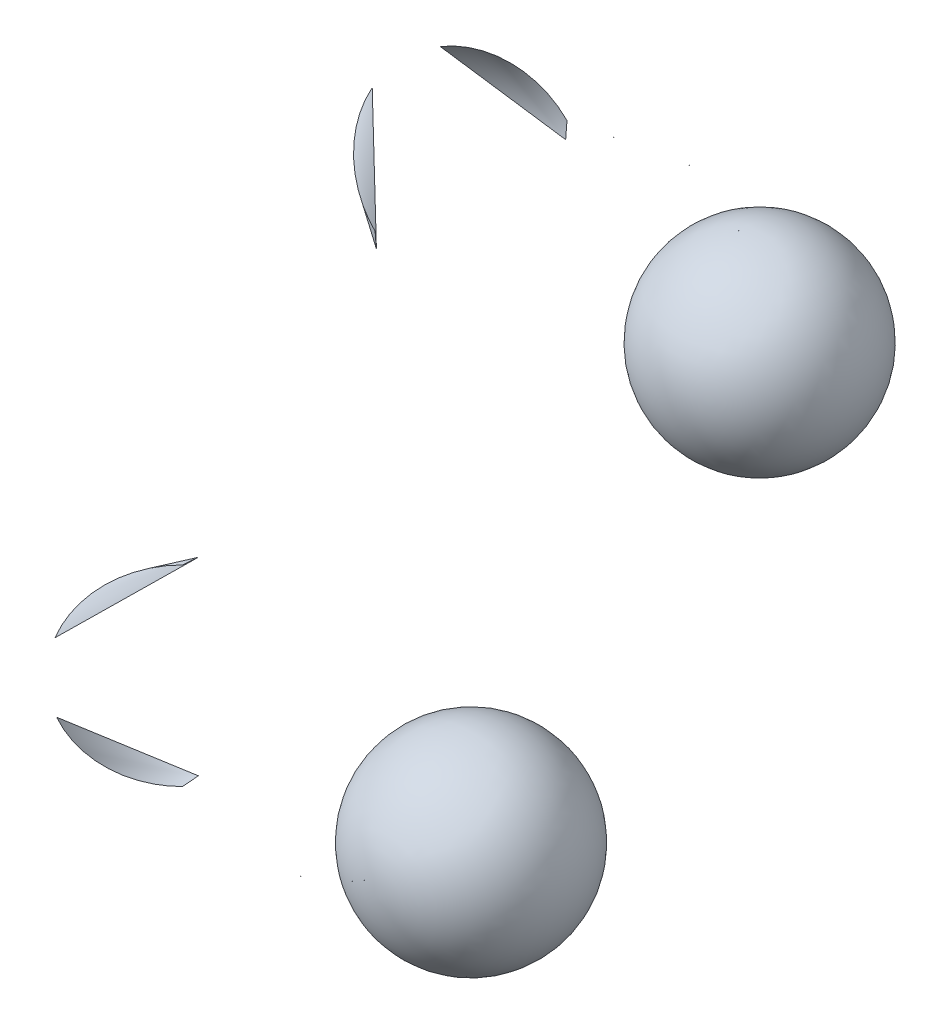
ISO-10303-21;
HEADER;
FILE_DESCRIPTION(('STEP AP214'),'2;1');
FILE_NAME('part.step','',(''),(''),'','','');
FILE_SCHEMA(('AUTOMOTIVE_DESIGN { 1 0 10303 214 1 1 1 1 }'));
ENDSEC;
DATA;
#1=APPLICATION_CONTEXT('core data for automotive mechanical design processes');
#2=APPLICATION_PROTOCOL_DEFINITION('international standard','automotive_design',2000,#1);
#3=PRODUCT_CONTEXT('',#1,'mechanical');
#4=PRODUCT('Part','Part','',(#3));
#5=PRODUCT_RELATED_PRODUCT_CATEGORY('part','',(#4));
#6=PRODUCT_DEFINITION_FORMATION('','',#4);
#7=PRODUCT_DEFINITION_CONTEXT('part definition',#1,'design');
#8=PRODUCT_DEFINITION('design','',#6,#7);
#9=PRODUCT_DEFINITION_SHAPE('','',#8);
#10=(LENGTH_UNIT() NAMED_UNIT(*) SI_UNIT(.MILLI.,.METRE.));
#11=(NAMED_UNIT(*) PLANE_ANGLE_UNIT() SI_UNIT($,.RADIAN.));
#12=(NAMED_UNIT(*) SI_UNIT($,.STERADIAN.) SOLID_ANGLE_UNIT());
#13=UNCERTAINTY_MEASURE_WITH_UNIT(LENGTH_MEASURE(1.E-05),#10,'distance_accuracy_value','');
#14=(GEOMETRIC_REPRESENTATION_CONTEXT(3) GLOBAL_UNCERTAINTY_ASSIGNED_CONTEXT((#13)) GLOBAL_UNIT_ASSIGNED_CONTEXT((#10,
#11,#12)) REPRESENTATION_CONTEXT('',''));
#15=CARTESIAN_POINT('',(0.,0.,0.));
#16=DIRECTION('',(0.,0.,1.));
#17=DIRECTION('',(1.,0.,0.));
#18=AXIS2_PLACEMENT_3D('',#15,#16,#17);
#19=CARTESIAN_POINT('',(4.5,0.,0.));
#20=DIRECTION('',(1.,0.,0.));
#21=DIRECTION('',(0.,-1.,0.));
#22=AXIS2_PLACEMENT_3D('',#19,#20,#21);
#23=TOROIDAL_SURFACE('',#22,10.025,0.0001);
#24=CARTESIAN_POINT('',(4.49996471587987,-3.28696064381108,-9.47092343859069));
#25=CARTESIAN_POINT('',(4.49995946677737,-3.28696031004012,-9.47092145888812));
#26=CARTESIAN_POINT('',(4.49995438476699,-3.28695990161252,-9.47091903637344));
#27=CARTESIAN_POINT('',(4.49994470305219,-3.28695894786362,-9.4709133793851));
#28=CARTESIAN_POINT('',(4.49994010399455,-3.28695840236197,-9.4709101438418));
#29=CARTESIAN_POINT('',(4.49993152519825,-3.28695719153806,-9.47090296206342));
#30=CARTESIAN_POINT('',(4.49992754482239,-3.28695652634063,-9.4708990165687));
#31=CARTESIAN_POINT('',(4.49992030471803,-3.28695509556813,-9.47089053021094));
#32=CARTESIAN_POINT('',(4.49991704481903,-3.28695433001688,-9.47088598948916));
#33=CARTESIAN_POINT('',(4.49991130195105,-3.28695271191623,-9.47087639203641));
#34=CARTESIAN_POINT('',(4.49990882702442,-3.28695185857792,-9.47087133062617));
#35=CARTESIAN_POINT('',(4.49990476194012,-3.28695009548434,-9.47086087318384));
#36=CARTESIAN_POINT('',(4.49990317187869,-3.28694918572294,-9.47085547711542));
#37=CARTESIAN_POINT('',(4.49990090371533,-3.28694732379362,-9.47084443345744));
#38=CARTESIAN_POINT('',(4.4999002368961,-3.28694637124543,-9.47083878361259));
#39=CARTESIAN_POINT('',(4.49989986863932,-3.28694446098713,-9.47082745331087));
#40=CARTESIAN_POINT('',(4.49990016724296,-3.28694350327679,-9.4708217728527));
#41=CARTESIAN_POINT('',(4.49990172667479,-3.28694160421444,-9.47081050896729));
#42=CARTESIAN_POINT('',(4.49990299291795,-3.28694066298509,-9.47080492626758));
#43=CARTESIAN_POINT('',(4.49990646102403,-3.28693882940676,-9.47079405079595));
#44=CARTESIAN_POINT('',(4.49990866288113,-3.28693793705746,-9.47078875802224));
#45=CARTESIAN_POINT('',(4.49991393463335,-3.28693623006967,-9.47077863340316));
#46=CARTESIAN_POINT('',(4.49991700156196,-3.2869354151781,-9.47077380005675));
#47=CARTESIAN_POINT('',(4.49992392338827,-3.28693388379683,-9.47076471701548));
#48=CARTESIAN_POINT('',(4.49992777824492,-3.286933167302,-9.47076046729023));
#49=CARTESIAN_POINT('',(4.49993612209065,-3.28693186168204,-9.47075272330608));
#50=CARTESIAN_POINT('',(4.49994060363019,-3.28693127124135,-9.47074922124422));
#51=CARTESIAN_POINT('',(4.49995010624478,-3.28693022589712,-9.47074302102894));
#52=CARTESIAN_POINT('',(4.49995512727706,-3.28692977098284,-9.47074032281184));
#53=CARTESIAN_POINT('',(4.49996549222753,-3.28692901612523,-9.47073584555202));
#54=CARTESIAN_POINT('',(4.49997083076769,-3.28692871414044,-9.47073405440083));
#55=CARTESIAN_POINT('',(4.49998173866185,-3.28692826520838,-9.47073139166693));
#56=CARTESIAN_POINT('',(4.49998730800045,-3.28692811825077,-9.47073052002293));
#57=CARTESIAN_POINT('',(4.4999984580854,-3.28692798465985,-9.47072972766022));
#58=CARTESIAN_POINT('',(4.50000403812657,-3.28692799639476,-9.47072979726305));
#59=CARTESIAN_POINT('',(4.50001510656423,-3.28692817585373,-9.47073086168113));
#60=CARTESIAN_POINT('',(4.50002059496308,-3.28692834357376,-9.47073185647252));
#61=CARTESIAN_POINT('',(4.50003131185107,-3.28692882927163,-9.4707347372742));
#62=CARTESIAN_POINT('',(4.50003654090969,-3.28692914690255,-9.47073662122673));
#63=CARTESIAN_POINT('',(4.50004660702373,-3.28692992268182,-9.47074122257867));
#64=CARTESIAN_POINT('',(4.50005144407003,-3.28693038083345,-9.47074393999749));
#65=CARTESIAN_POINT('',(4.50006062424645,-3.2869314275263,-9.47075014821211));
#66=CARTESIAN_POINT('',(4.50006496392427,-3.28693201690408,-9.47075364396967));
#67=CARTESIAN_POINT('',(4.50007299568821,-3.28693330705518,-9.47076129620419));
#68=CARTESIAN_POINT('',(4.50007668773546,-3.28693400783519,-9.47076545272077));
#69=CARTESIAN_POINT('',(4.50008336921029,-3.2869355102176,-9.47077436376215));
#70=CARTESIAN_POINT('',(4.50008634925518,-3.2869363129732,-9.47077912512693));
#71=CARTESIAN_POINT('',(4.50009146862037,-3.28693798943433,-9.47078906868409));
#72=CARTESIAN_POINT('',(4.50009360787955,-3.28693886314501,-9.47079425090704));
#73=CARTESIAN_POINT('',(4.50009701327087,-3.28694066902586,-9.47080496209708));
#74=CARTESIAN_POINT('',(4.5000982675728,-3.28694160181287,-9.4708104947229));
#75=CARTESIAN_POINT('',(4.50009982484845,-3.28694348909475,-9.47082168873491));
#76=CARTESIAN_POINT('',(4.50010012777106,-3.28694444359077,-9.47082735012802));
#77=CARTESIAN_POINT('',(4.50009977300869,-3.28694635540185,-9.47083868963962));
#78=CARTESIAN_POINT('',(4.5000991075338,-3.28694731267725,-9.47084436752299));
#79=CARTESIAN_POINT('',(4.50009681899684,-3.28694919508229,-9.4708555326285));
#80=CARTESIAN_POINT('',(4.50009519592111,-3.28695012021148,-9.47086101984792));
#81=CARTESIAN_POINT('',(4.50009103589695,-3.28695191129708,-9.47087164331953));
#82=CARTESIAN_POINT('',(4.50008849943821,-3.28695277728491,-9.47087677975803));
#83=CARTESIAN_POINT('',(4.50008258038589,-3.2869544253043,-9.47088655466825));
#84=CARTESIAN_POINT('',(4.50007919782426,-3.28695520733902,-9.47089119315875));
#85=CARTESIAN_POINT('',(4.50007171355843,-3.28695665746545,-9.47089979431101));
#86=CARTESIAN_POINT('',(4.50006761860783,-3.28695732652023,-9.47090376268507));
#87=CARTESIAN_POINT('',(4.50005880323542,-3.28695853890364,-9.47091095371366));
#88=CARTESIAN_POINT('',(4.50005408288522,-3.28695908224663,-9.47091417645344));
#89=CARTESIAN_POINT('',(4.5000442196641,-3.28696001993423,-9.47091973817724));
#90=CARTESIAN_POINT('',(4.50003908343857,-3.28696041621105,-9.47092208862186));
#91=CARTESIAN_POINT('',(4.50002847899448,-3.28696105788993,-9.47092589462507));
#92=CARTESIAN_POINT('',(4.50002301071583,-3.2869613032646,-9.47092735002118));
#93=CARTESIAN_POINT('',(4.50001196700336,-3.28696163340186,-9.47092930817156));
#94=CARTESIAN_POINT('',(4.50000639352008,-3.28696171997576,-9.47092982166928));
#95=CARTESIAN_POINT('',(4.4999952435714,-3.28696173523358,-9.47092991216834));
#96=CARTESIAN_POINT('',(4.49998966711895,-3.28696166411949,-9.47092949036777));
#97=CARTESIAN_POINT('',(4.49998084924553,-3.28696142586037,-9.47092807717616));
#98=CARTESIAN_POINT('',(4.49997755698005,-3.28696130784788,-9.47092737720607));
#99=CARTESIAN_POINT('',(4.4999710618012,-3.2869610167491,-9.47092565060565));
#100=CARTESIAN_POINT('',(4.49996785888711,-3.28696084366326,-9.470924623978));
#101=CARTESIAN_POINT('',(4.49996471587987,-3.28696064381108,-9.47092343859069));
#102=B_SPLINE_CURVE_WITH_KNOTS('',3,(#24,#25,#26,#27,#28,#29,#30,#31,#32,#33,#34,#35,#36,#37,
#38,#39,#40,#41,#42,#43,#44,#45,#46,#47,#48,#49,#50,#51,#52,#53,#54,#55,#56,#57,#58,#59,#60,#61,
#62,#63,#64,#65,#66,#67,#68,#69,#70,#71,#72,#73,#74,#75,#76,#77,#78,#79,#80,#81,#82,#83,#84,#85,
#86,#87,#88,#89,#90,#91,#92,#93,#94,#95,#96,#97,#98,#99,#100,#101),.UNSPECIFIED.,.T.,.F.,(4,2,2,
2,2,2,2,2,2,2,2,2,2,2,2,2,2,2,2,2,2,2,2,2,2,2,2,2,2,2,2,2,2,2,2,2,2,2,4),(0.,
1.68473484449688E-05,3.37169788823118E-05,5.05691180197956E-05,6.74172645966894E-05,
8.44328331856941E-05,0.000101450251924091,0.000118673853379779,0.00013589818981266,
0.000153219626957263,0.000170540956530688,0.000187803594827,0.000205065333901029,
0.0002221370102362,0.000239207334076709,0.000256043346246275,0.000272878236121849,
0.00028954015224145,0.000306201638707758,0.000322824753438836,0.000339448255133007,
0.00035618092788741,0.000372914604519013,0.000389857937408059,0.000406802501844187,
0.00042396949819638,0.0004411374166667,0.000458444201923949,0.000475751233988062,
0.000493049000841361,0.000510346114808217,0.00052748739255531,0.000544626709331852,
0.000561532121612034,0.000578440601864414,0.000595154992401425,0.000611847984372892,
0.000621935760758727,0.000632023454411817),.UNSPECIFIED.);
#103=CARTESIAN_POINT('',(4.49996471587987,-3.28696064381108,-9.47092343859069));
#104=VERTEX_POINT('',#103);
#105=EDGE_CURVE('E10',#104,#104,#102,.T.);
#106=ORIENTED_EDGE('',*,*,#105,.F.);
#107=EDGE_LOOP('',(#106));
#108=FACE_BOUND('',#107,.T.);
#109=CARTESIAN_POINT('',(4.49996471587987,-9.47092343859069,-3.28696064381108));
#110=CARTESIAN_POINT('',(4.49996989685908,-9.47092539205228,-3.28696097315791));
#111=CARTESIAN_POINT('',(4.49997524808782,-9.47092691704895,-3.286961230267));
#112=CARTESIAN_POINT('',(4.4999861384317,-9.47092906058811,-3.28696159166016));
#113=CARTESIAN_POINT('',(4.49999167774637,-9.47092967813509,-3.28696169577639));
#114=CARTESIAN_POINT('',(4.50000278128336,-9.47092998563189,-3.28696174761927));
#115=CARTESIAN_POINT('',(4.50000834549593,-9.47092967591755,-3.28696169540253));
#116=CARTESIAN_POINT('',(4.50001934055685,-9.47092813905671,-3.28696143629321));
#117=CARTESIAN_POINT('',(4.50002477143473,-9.47092691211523,-3.2869612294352));
#118=CARTESIAN_POINT('',(4.50003534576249,-9.47092357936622,-3.28696066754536));
#119=CARTESIAN_POINT('',(4.50004048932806,-9.47092147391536,-3.28696031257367));
#120=CARTESIAN_POINT('',(4.50005034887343,-9.47091644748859,-3.28695946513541));
#121=CARTESIAN_POINT('',(4.50005506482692,-9.47091352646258,-3.28695897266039));
#122=CARTESIAN_POINT('',(4.50006397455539,-9.47090693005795,-3.28695786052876));
#123=CARTESIAN_POINT('',(4.50006816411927,-9.47090324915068,-3.28695723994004));
#124=CARTESIAN_POINT('',(4.50007586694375,-9.47089525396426,-3.28695589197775));
#125=CARTESIAN_POINT('',(4.50007938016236,-9.4708909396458,-3.28695516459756));
#126=CARTESIAN_POINT('',(4.50008567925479,-9.47088174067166,-3.28695361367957));
#127=CARTESIAN_POINT('',(4.50008845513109,-9.47087684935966,-3.28695278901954));
#128=CARTESIAN_POINT('',(4.50009314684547,-9.47086668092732,-3.28695107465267));
#129=CARTESIAN_POINT('',(4.50009506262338,-9.47086140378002,-3.2869501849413));
#130=CARTESIAN_POINT('',(4.50009800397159,-9.47085054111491,-3.28694835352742));
#131=CARTESIAN_POINT('',(4.50009901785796,-9.47084495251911,-3.28694741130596));
#132=CARTESIAN_POINT('',(4.50010008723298,-9.47083368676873,-3.28694551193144));
#133=CARTESIAN_POINT('',(4.50010014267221,-9.4708280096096,-3.28694455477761));
#134=CARTESIAN_POINT('',(4.5000992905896,-9.47081668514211,-3.28694264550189));
#135=CARTESIAN_POINT('',(4.50009837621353,-9.47081103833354,-3.28694169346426));
#136=CARTESIAN_POINT('',(4.50009559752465,-9.47079997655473,-3.28693982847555));
#137=CARTESIAN_POINT('',(4.50009373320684,-9.47079456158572,-3.28693891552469));
#138=CARTESIAN_POINT('',(4.50008910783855,-9.47078412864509,-3.2869371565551));
#139=CARTESIAN_POINT('',(4.500086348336,-9.47077911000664,-3.28693631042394));
#140=CARTESIAN_POINT('',(4.50008000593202,-9.47076960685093,-3.28693470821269));
#141=CARTESIAN_POINT('',(4.50007642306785,-9.47076512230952,-3.28693395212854));
#142=CARTESIAN_POINT('',(4.500068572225,-9.47075686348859,-3.28693255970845));
#143=CARTESIAN_POINT('',(4.50006431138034,-9.47075308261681,-3.2869319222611));
#144=CARTESIAN_POINT('',(4.50005519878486,-9.47074629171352,-3.28693077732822));
#145=CARTESIAN_POINT('',(4.50005034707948,-9.4707432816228,-3.28693026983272));
#146=CARTESIAN_POINT('',(4.5000402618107,-9.47073816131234,-3.2869294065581));
#147=CARTESIAN_POINT('',(4.50003503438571,-9.47073603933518,-3.2869290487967));
#148=CARTESIAN_POINT('',(4.50002428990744,-9.47073270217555,-3.28692848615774));
#149=CARTESIAN_POINT('',(4.50001877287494,-9.47073148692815,-3.28692828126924));
#150=CARTESIAN_POINT('',(4.50000767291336,-9.47073000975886,-3.28692803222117));
#151=CARTESIAN_POINT('',(4.50000209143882,-9.47072973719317,-3.28692798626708));
#152=CARTESIAN_POINT('',(4.49999096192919,-9.47073012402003,-3.28692805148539));
#153=CARTESIAN_POINT('',(4.49998541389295,-9.47073078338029,-3.28692816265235));
#154=CARTESIAN_POINT('',(4.49997453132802,-9.47073300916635,-3.28692853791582));
#155=CARTESIAN_POINT('',(4.49996919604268,-9.4707345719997,-3.28692880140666));
#156=CARTESIAN_POINT('',(4.49995886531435,-9.47073855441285,-3.2869294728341));
#157=CARTESIAN_POINT('',(4.49995386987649,-9.47074097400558,-3.28692988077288));
#158=CARTESIAN_POINT('',(4.49994433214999,-9.47074661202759,-3.28693083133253));
#159=CARTESIAN_POINT('',(4.49993979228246,-9.47074983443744,-3.28693137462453));
#160=CARTESIAN_POINT('',(4.49993131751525,-9.47075697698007,-3.28693257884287));
#161=CARTESIAN_POINT('',(4.49992738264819,-9.47076089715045,-3.28693323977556));
#162=CARTESIAN_POINT('',(4.49992017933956,-9.47076937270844,-3.28693466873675));
#163=CARTESIAN_POINT('',(4.49991691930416,-9.47077393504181,-3.2869354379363));
#164=CARTESIAN_POINT('',(4.49991121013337,-9.47078352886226,-3.28693705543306));
#165=CARTESIAN_POINT('',(4.49990876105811,-9.47078856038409,-3.28693790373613));
#166=CARTESIAN_POINT('',(4.499904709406,-9.4707990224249,-3.28693966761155));
#167=CARTESIAN_POINT('',(4.49990311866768,-9.47080445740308,-3.28694058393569));
#168=CARTESIAN_POINT('',(4.49990087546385,-9.47081551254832,-3.28694244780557));
#169=CARTESIAN_POINT('',(4.49990022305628,-9.47082113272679,-3.28694339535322));
#170=CARTESIAN_POINT('',(4.49989987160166,-9.47083245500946,-3.28694530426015));
#171=CARTESIAN_POINT('',(4.4999001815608,-9.47083815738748,-3.28694626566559));
#172=CARTESIAN_POINT('',(4.49990176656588,-9.47084943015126,-3.28694816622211));
#173=CARTESIAN_POINT('',(4.49990304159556,-9.47085500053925,-3.28694910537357));
#174=CARTESIAN_POINT('',(4.49990652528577,-9.47086585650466,-3.28695093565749));
#175=CARTESIAN_POINT('',(4.4999087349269,-9.47087114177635,-3.2869518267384));
#176=CARTESIAN_POINT('',(4.49991403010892,-9.47088126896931,-3.28695353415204));
#177=CARTESIAN_POINT('',(4.4999171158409,-9.47088611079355,-3.28695435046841));
#178=CARTESIAN_POINT('',(4.4999240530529,-9.47089517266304,-3.28695587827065));
#179=CARTESIAN_POINT('',(4.49992789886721,-9.4708993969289,-3.28695659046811));
#180=CARTESIAN_POINT('',(4.49993626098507,-9.47090713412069,-3.28695789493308));
#181=CARTESIAN_POINT('',(4.49994077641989,-9.47091064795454,-3.28695848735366));
#182=CARTESIAN_POINT('',(4.49994856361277,-9.47091570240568,-3.28695933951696));
#183=CARTESIAN_POINT('',(4.49995167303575,-9.47091749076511,-3.28695964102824));
#184=CARTESIAN_POINT('',(4.49995806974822,-9.47092072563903,-3.28696018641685));
#185=CARTESIAN_POINT('',(4.4999613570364,-9.47092217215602,-3.28696043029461));
#186=CARTESIAN_POINT('',(4.49996471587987,-9.47092343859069,-3.28696064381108));
#187=B_SPLINE_CURVE_WITH_KNOTS('',3,(#109,#110,#111,#112,#113,#114,#115,#116,#117,#118,#119,
#120,#121,#122,#123,#124,#125,#126,#127,#128,#129,#130,#131,#132,#133,#134,#135,#136,#137,#138,
#139,#140,#141,#142,#143,#144,#145,#146,#147,#148,#149,#150,#151,#152,#153,#154,#155,#156,#157,
#158,#159,#160,#161,#162,#163,#164,#165,#166,#167,#168,#169,#170,#171,#172,#173,#174,#175,#176,
#177,#178,#179,#180,#181,#182,#183,#184,#185,#186),.UNSPECIFIED.,.T.,.F.,(4,2,2,2,2,2,2,2,2,2,2,
2,2,2,2,2,2,2,2,2,2,2,2,2,2,2,2,2,2,2,2,2,2,2,2,2,2,2,4),(0.,1.66273558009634E-05,
3.32729386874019E-05,4.99124934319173E-05,6.65483299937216E-05,8.31774189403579E-05,
9.9807529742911E-05,0.00011656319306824,0.000133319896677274,0.000150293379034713,
0.000167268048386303,0.00018445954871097,0.000201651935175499,0.000218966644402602,
0.000236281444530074,0.000253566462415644,0.000270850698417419,0.000287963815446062,
0.000305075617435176,0.000321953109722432,0.000338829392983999,0.00035551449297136,
0.000372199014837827,0.000388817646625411,0.000405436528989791,0.000422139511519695,
0.000438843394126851,0.000455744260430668,0.000472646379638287,0.000489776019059,
0.000506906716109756,0.000524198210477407,0.000541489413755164,0.000558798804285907,
0.000576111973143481,0.000593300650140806,0.000610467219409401,0.000621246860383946,
0.000632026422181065),.UNSPECIFIED.);
#188=CARTESIAN_POINT('',(4.49996471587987,-9.47092343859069,-3.28696064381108));
#189=VERTEX_POINT('',#188);
#190=EDGE_CURVE('E30',#189,#189,#187,.T.);
#191=ORIENTED_EDGE('',*,*,#190,.F.);
#192=EDGE_LOOP('',(#191));
#193=FACE_BOUND('',#192,.T.);
#194=ADVANCED_FACE('F14',(#108,#193),#23,.T.);
#195=CARTESIAN_POINT('',(4.49996471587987,3.28696064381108,-9.47092343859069));
#196=CARTESIAN_POINT('',(4.49996989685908,3.28696097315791,-9.47092539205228));
#197=CARTESIAN_POINT('',(4.49997524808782,3.286961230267,-9.47092691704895));
#198=CARTESIAN_POINT('',(4.4999861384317,3.28696159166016,-9.47092906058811));
#199=CARTESIAN_POINT('',(4.49999167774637,3.28696169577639,-9.47092967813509));
#200=CARTESIAN_POINT('',(4.50000278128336,3.28696174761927,-9.47092998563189));
#201=CARTESIAN_POINT('',(4.50000834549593,3.28696169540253,-9.47092967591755));
#202=CARTESIAN_POINT('',(4.50001934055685,3.28696143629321,-9.47092813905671));
#203=CARTESIAN_POINT('',(4.50002477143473,3.2869612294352,-9.47092691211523));
#204=CARTESIAN_POINT('',(4.50003534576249,3.28696066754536,-9.47092357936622));
#205=CARTESIAN_POINT('',(4.50004048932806,3.28696031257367,-9.47092147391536));
#206=CARTESIAN_POINT('',(4.50005034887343,3.28695946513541,-9.47091644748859));
#207=CARTESIAN_POINT('',(4.50005506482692,3.28695897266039,-9.47091352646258));
#208=CARTESIAN_POINT('',(4.50006397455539,3.28695786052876,-9.47090693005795));
#209=CARTESIAN_POINT('',(4.50006816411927,3.28695723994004,-9.47090324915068));
#210=CARTESIAN_POINT('',(4.50007586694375,3.28695589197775,-9.47089525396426));
#211=CARTESIAN_POINT('',(4.50007938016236,3.28695516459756,-9.4708909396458));
#212=CARTESIAN_POINT('',(4.50008567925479,3.28695361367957,-9.47088174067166));
#213=CARTESIAN_POINT('',(4.50008845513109,3.28695278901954,-9.47087684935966));
#214=CARTESIAN_POINT('',(4.50009314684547,3.28695107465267,-9.47086668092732));
#215=CARTESIAN_POINT('',(4.50009506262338,3.2869501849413,-9.47086140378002));
#216=CARTESIAN_POINT('',(4.50009800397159,3.28694835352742,-9.47085054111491));
#217=CARTESIAN_POINT('',(4.50009901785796,3.28694741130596,-9.47084495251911));
#218=CARTESIAN_POINT('',(4.50010008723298,3.28694551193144,-9.47083368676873));
#219=CARTESIAN_POINT('',(4.50010014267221,3.28694455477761,-9.4708280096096));
#220=CARTESIAN_POINT('',(4.5000992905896,3.28694264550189,-9.47081668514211));
#221=CARTESIAN_POINT('',(4.50009837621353,3.28694169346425,-9.47081103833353));
#222=CARTESIAN_POINT('',(4.50009559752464,3.28693982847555,-9.47079997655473));
#223=CARTESIAN_POINT('',(4.50009373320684,3.28693891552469,-9.47079456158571));
#224=CARTESIAN_POINT('',(4.50008910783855,3.2869371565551,-9.47078412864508));
#225=CARTESIAN_POINT('',(4.50008634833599,3.28693631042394,-9.47077911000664));
#226=CARTESIAN_POINT('',(4.50008000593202,3.28693470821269,-9.47076960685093));
#227=CARTESIAN_POINT('',(4.50007642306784,3.28693395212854,-9.47076512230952));
#228=CARTESIAN_POINT('',(4.500068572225,3.28693255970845,-9.47075686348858));
#229=CARTESIAN_POINT('',(4.50006431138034,3.28693192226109,-9.47075308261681));
#230=CARTESIAN_POINT('',(4.50005519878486,3.28693077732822,-9.47074629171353));
#231=CARTESIAN_POINT('',(4.50005034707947,3.28693026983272,-9.47074328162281));
#232=CARTESIAN_POINT('',(4.50004026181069,3.2869294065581,-9.47073816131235));
#233=CARTESIAN_POINT('',(4.5000350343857,3.2869290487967,-9.47073603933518));
#234=CARTESIAN_POINT('',(4.50002428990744,3.28692848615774,-9.47073270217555));
#235=CARTESIAN_POINT('',(4.50001877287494,3.28692828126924,-9.47073148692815));
#236=CARTESIAN_POINT('',(4.50000767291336,3.28692803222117,-9.47073000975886));
#237=CARTESIAN_POINT('',(4.50000209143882,3.28692798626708,-9.47072973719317));
#238=CARTESIAN_POINT('',(4.49999096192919,3.28692805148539,-9.47073012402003));
#239=CARTESIAN_POINT('',(4.49998541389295,3.28692816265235,-9.47073078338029));
#240=CARTESIAN_POINT('',(4.49997453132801,3.28692853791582,-9.47073300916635));
#241=CARTESIAN_POINT('',(4.49996919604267,3.28692880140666,-9.47073457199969));
#242=CARTESIAN_POINT('',(4.49995886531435,3.2869294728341,-9.47073855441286));
#243=CARTESIAN_POINT('',(4.49995386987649,3.28692988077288,-9.47074097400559));
#244=CARTESIAN_POINT('',(4.49994433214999,3.28693083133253,-9.4707466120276));
#245=CARTESIAN_POINT('',(4.49993979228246,3.28693137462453,-9.47074983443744));
#246=CARTESIAN_POINT('',(4.49993131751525,3.28693257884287,-9.47075697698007));
#247=CARTESIAN_POINT('',(4.49992738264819,3.28693323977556,-9.47076089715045));
#248=CARTESIAN_POINT('',(4.49992017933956,3.28693466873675,-9.47076937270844));
#249=CARTESIAN_POINT('',(4.49991691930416,3.2869354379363,-9.47077393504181));
#250=CARTESIAN_POINT('',(4.49991121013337,3.28693705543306,-9.47078352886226));
#251=CARTESIAN_POINT('',(4.49990876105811,3.28693790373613,-9.47078856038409));
#252=CARTESIAN_POINT('',(4.499904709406,3.28693966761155,-9.4707990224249));
#253=CARTESIAN_POINT('',(4.49990311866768,3.28694058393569,-9.47080445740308));
#254=CARTESIAN_POINT('',(4.49990087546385,3.28694244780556,-9.47081551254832));
#255=CARTESIAN_POINT('',(4.49990022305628,3.28694339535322,-9.47082113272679));
#256=CARTESIAN_POINT('',(4.49989987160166,3.28694530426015,-9.47083245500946));
#257=CARTESIAN_POINT('',(4.4999001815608,3.28694626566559,-9.47083815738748));
#258=CARTESIAN_POINT('',(4.49990176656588,3.28694816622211,-9.47084943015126));
#259=CARTESIAN_POINT('',(4.49990304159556,3.28694910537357,-9.47085500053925));
#260=CARTESIAN_POINT('',(4.49990652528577,3.28695093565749,-9.47086585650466));
#261=CARTESIAN_POINT('',(4.4999087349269,3.2869518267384,-9.47087114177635));
#262=CARTESIAN_POINT('',(4.49991403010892,3.28695353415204,-9.47088126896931));
#263=CARTESIAN_POINT('',(4.4999171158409,3.28695435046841,-9.47088611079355));
#264=CARTESIAN_POINT('',(4.4999240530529,3.28695587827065,-9.47089517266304));
#265=CARTESIAN_POINT('',(4.49992789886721,3.28695659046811,-9.4708993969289));
#266=CARTESIAN_POINT('',(4.49993626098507,3.28695789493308,-9.47090713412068));
#267=CARTESIAN_POINT('',(4.49994077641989,3.28695848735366,-9.47091064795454));
#268=CARTESIAN_POINT('',(4.49994856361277,3.28695933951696,-9.47091570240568));
#269=CARTESIAN_POINT('',(4.49995167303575,3.28695964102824,-9.47091749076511));
#270=CARTESIAN_POINT('',(4.49995806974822,3.28696018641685,-9.47092072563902));
#271=CARTESIAN_POINT('',(4.4999613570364,3.28696043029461,-9.47092217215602));
#272=CARTESIAN_POINT('',(4.49996471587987,3.28696064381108,-9.47092343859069));
#273=B_SPLINE_CURVE_WITH_KNOTS('',3,(#195,#196,#197,#198,#199,#200,#201,#202,#203,#204,#205,
#206,#207,#208,#209,#210,#211,#212,#213,#214,#215,#216,#217,#218,#219,#220,#221,#222,#223,#224,
#225,#226,#227,#228,#229,#230,#231,#232,#233,#234,#235,#236,#237,#238,#239,#240,#241,#242,#243,
#244,#245,#246,#247,#248,#249,#250,#251,#252,#253,#254,#255,#256,#257,#258,#259,#260,#261,#262,
#263,#264,#265,#266,#267,#268,#269,#270,#271,#272),.UNSPECIFIED.,.T.,.F.,(4,2,2,2,2,2,2,2,2,2,2,
2,2,2,2,2,2,2,2,2,2,2,2,2,2,2,2,2,2,2,2,2,2,2,2,2,2,2,4),(0.,1.66273558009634E-05,
3.32729386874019E-05,4.99124934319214E-05,6.65483299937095E-05,8.31774189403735E-05,
9.98075297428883E-05,0.000116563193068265,0.000133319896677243,0.000150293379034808,
0.000167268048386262,0.000184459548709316,0.000201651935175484,0.000218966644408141,
0.00023628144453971,0.000253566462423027,0.000270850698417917,0.000287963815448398,
0.000305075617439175,0.000321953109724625,0.000338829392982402,0.000355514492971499,
0.00037219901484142,0.000388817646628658,0.000405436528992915,0.000422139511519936,
0.000438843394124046,0.000455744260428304,0.000472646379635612,0.000489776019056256,
0.000506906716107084,0.000524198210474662,0.000541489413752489,0.000558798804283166,
0.000576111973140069,0.000593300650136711,0.00061046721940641,0.000621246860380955,
0.000632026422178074),.UNSPECIFIED.);
#274=CARTESIAN_POINT('',(4.49996471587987,3.28696064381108,-9.47092343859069));
#275=VERTEX_POINT('',#274);
#276=EDGE_CURVE('E26',#275,#275,#273,.T.);
#277=ORIENTED_EDGE('',*,*,#276,.F.);
#278=EDGE_LOOP('',(#277));
#279=FACE_BOUND('',#278,.T.);
#280=CARTESIAN_POINT('',(4.49991704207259,9.47088570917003,-3.28695428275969));
#281=CARTESIAN_POINT('',(4.49991386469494,9.47088098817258,-3.2869534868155));
#282=CARTESIAN_POINT('',(4.49991109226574,9.47087599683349,-3.28695264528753));
#283=CARTESIAN_POINT('',(4.49990643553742,9.47086562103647,-3.28695089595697));
#284=CARTESIAN_POINT('',(4.49990455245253,9.47086023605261,-3.28694998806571));
#285=CARTESIAN_POINT('',(4.49990172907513,9.47084923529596,-3.28694813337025));
#286=CARTESIAN_POINT('',(4.4999007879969,9.47084361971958,-3.28694718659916));
#287=CARTESIAN_POINT('',(4.49989986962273,9.47083231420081,-3.28694528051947));
#288=CARTESIAN_POINT('',(4.4998998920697,9.47082662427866,-3.2869443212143));
#289=CARTESIAN_POINT('',(4.49990090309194,9.47081529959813,-3.28694241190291));
#290=CARTESIAN_POINT('',(4.49990189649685,9.47080966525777,-3.28694146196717));
#291=CARTESIAN_POINT('',(4.49990483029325,9.47079864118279,-3.286939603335));
#292=CARTESIAN_POINT('',(4.49990677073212,9.47079325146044,-3.28693869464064));
#293=CARTESIAN_POINT('',(4.49991154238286,9.47078288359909,-3.28693694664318));
#294=CARTESIAN_POINT('',(4.49991437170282,9.47077790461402,-3.28693610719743));
#295=CARTESIAN_POINT('',(4.49992084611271,9.47076849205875,-3.28693452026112));
#296=CARTESIAN_POINT('',(4.49992449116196,9.47076405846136,-3.28693377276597));
#297=CARTESIAN_POINT('',(4.49993245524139,9.47075591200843,-3.28693239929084));
#298=CARTESIAN_POINT('',(4.49993676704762,9.47075219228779,-3.2869317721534));
#299=CARTESIAN_POINT('',(4.49994597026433,9.47074553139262,-3.28693064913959));
#300=CARTESIAN_POINT('',(4.49995086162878,9.47074259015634,-3.2869301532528));
#301=CARTESIAN_POINT('',(4.49996101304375,9.47073761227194,-3.28692931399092));
#302=CARTESIAN_POINT('',(4.49996626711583,9.47073556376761,-3.28692896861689));
#303=CARTESIAN_POINT('',(4.49997705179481,9.47073237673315,-3.28692843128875));
#304=CARTESIAN_POINT('',(4.49998258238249,9.47073123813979,-3.28692823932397));
#305=CARTESIAN_POINT('',(4.49999369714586,9.47072991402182,-3.28692801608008));
#306=CARTESIAN_POINT('',(4.49999928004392,9.47072971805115,-3.28692798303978));
#307=CARTESIAN_POINT('',(4.50001039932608,9.47073025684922,-3.28692807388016));
#308=CARTESIAN_POINT('',(4.5000159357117,9.47073099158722,-3.28692819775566));
#309=CARTESIAN_POINT('',(4.50002678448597,9.47073336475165,-3.28692859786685));
#310=CARTESIAN_POINT('',(4.50003209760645,9.47073499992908,-3.28692887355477));
#311=CARTESIAN_POINT('',(4.50004237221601,9.47073912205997,-3.28692956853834));
#312=CARTESIAN_POINT('',(4.5000473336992,9.47074160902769,-3.2869299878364));
#313=CARTESIAN_POINT('',(4.5000567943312,9.47074737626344,-3.28693096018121));
#314=CARTESIAN_POINT('',(4.50006129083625,9.47075066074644,-3.28693151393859));
#315=CARTESIAN_POINT('',(4.50006966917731,9.47075791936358,-3.28693273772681));
#316=CARTESIAN_POINT('',(4.50007355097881,9.47076189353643,-3.28693340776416));
#317=CARTESIAN_POINT('',(4.50008063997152,9.47077046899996,-3.28693485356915));
#318=CARTESIAN_POINT('',(4.50008383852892,9.47077507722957,-3.28693563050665));
#319=CARTESIAN_POINT('',(4.50008941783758,9.47078475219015,-3.28693726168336));
#320=CARTESIAN_POINT('',(4.50009179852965,9.47078981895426,-3.28693811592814));
#321=CARTESIAN_POINT('',(4.50009570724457,9.47080034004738,-3.28693988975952));
#322=CARTESIAN_POINT('',(4.50009722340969,9.4708057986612,-3.28694081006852));
#323=CARTESIAN_POINT('',(4.50009931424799,9.47081688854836,-3.28694267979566));
#324=CARTESIAN_POINT('',(4.50009988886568,9.47082251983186,-3.28694362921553));
#325=CARTESIAN_POINT('',(4.50010008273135,9.47083384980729,-3.28694553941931));
#326=CARTESIAN_POINT('',(4.50009969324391,9.47083954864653,-3.28694650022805));
#327=CARTESIAN_POINT('',(4.50009795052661,9.47085080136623,-3.28694839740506));
#328=CARTESIAN_POINT('',(4.50009659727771,9.47085635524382,-3.28694933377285));
#329=CARTESIAN_POINT('',(4.50009296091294,9.47086716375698,-3.28695115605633));
#330=CARTESIAN_POINT('',(4.50009067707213,9.4708724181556,-3.28695204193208));
#331=CARTESIAN_POINT('',(4.50008524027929,9.47088247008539,-3.28695373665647));
#332=CARTESIAN_POINT('',(4.50008208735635,9.47088726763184,-3.28695454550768));
#333=CARTESIAN_POINT('',(4.50007502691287,9.47089622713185,-3.28695605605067));
#334=CARTESIAN_POINT('',(4.50007112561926,9.47090039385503,-3.28695675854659));
#335=CARTESIAN_POINT('',(4.50006266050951,9.47090801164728,-3.28695804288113));
#336=CARTESIAN_POINT('',(4.50005809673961,9.47091146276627,-3.28695862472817));
#337=CARTESIAN_POINT('',(4.50004850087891,9.47091750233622,-3.28695964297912));
#338=CARTESIAN_POINT('',(4.50004347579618,9.47092010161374,-3.28696008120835));
#339=CARTESIAN_POINT('',(4.50003305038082,9.47092441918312,-3.28696080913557));
#340=CARTESIAN_POINT('',(4.50002765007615,9.47092613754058,-3.28696109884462));
#341=CARTESIAN_POINT('',(4.50001670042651,9.47092862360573,-3.28696151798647));
#342=CARTESIAN_POINT('',(4.50001115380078,9.47092940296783,-3.28696164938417));
#343=CARTESIAN_POINT('',(4.50000000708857,9.47093002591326,-3.28696175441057));
#344=CARTESIAN_POINT('',(4.49999440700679,9.47092986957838,-3.28696172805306));
#345=CARTESIAN_POINT('',(4.49998334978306,9.47092863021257,-3.28696151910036));
#346=CARTESIAN_POINT('',(4.4999778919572,9.4709275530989,-3.28696133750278));
#347=CARTESIAN_POINT('',(4.49996723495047,9.47092451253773,-3.28696082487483));
#348=CARTESIAN_POINT('',(4.4999620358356,9.47092254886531,-3.28696049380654));
#349=CARTESIAN_POINT('',(4.49995202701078,9.47091778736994,-3.28695969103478));
#350=CARTESIAN_POINT('',(4.4999472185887,9.47091498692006,-3.28695921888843));
#351=CARTESIAN_POINT('',(4.49993814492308,9.47090863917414,-3.28695814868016));
#352=CARTESIAN_POINT('',(4.49993387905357,9.47090509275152,-3.28695755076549));
#353=CARTESIAN_POINT('',(4.49992753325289,9.47089886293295,-3.28695650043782));
#354=CARTESIAN_POINT('',(4.49992524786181,9.47089637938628,-3.28695608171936));
#355=CARTESIAN_POINT('',(4.49992094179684,9.47089119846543,-3.28695520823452));
#356=CARTESIAN_POINT('',(4.49991892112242,9.47088850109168,-3.28695475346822));
#357=CARTESIAN_POINT('',(4.49991704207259,9.47088570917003,-3.28695428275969));
#358=B_SPLINE_CURVE_WITH_KNOTS('',3,(#280,#281,#282,#283,#284,#285,#286,#287,#288,#289,#290,
#291,#292,#293,#294,#295,#296,#297,#298,#299,#300,#301,#302,#303,#304,#305,#306,#307,#308,#309,
#310,#311,#312,#313,#314,#315,#316,#317,#318,#319,#320,#321,#322,#323,#324,#325,#326,#327,#328,
#329,#330,#331,#332,#333,#334,#335,#336,#337,#338,#339,#340,#341,#342,#343,#344,#345,#346,#347,
#348,#349,#350,#351,#352,#353,#354,#355,#356,#357),.UNSPECIFIED.,.T.,.F.,(4,2,2,2,2,2,2,2,2,2,2,
2,2,2,2,2,2,2,2,2,2,2,2,2,2,2,2,2,2,2,2,2,2,2,2,2,2,2,4),(0.,1.72256086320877E-05,
3.44746680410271E-05,5.17093282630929E-05,6.89393899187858E-05,8.62555942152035E-05,
0.000103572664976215,0.000120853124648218,0.000138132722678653,0.000155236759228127,
0.000172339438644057,0.000189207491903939,0.000206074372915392,0.00022275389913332,
0.000239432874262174,0.000256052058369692,0.000272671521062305,0.000289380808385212,
0.000306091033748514,0.000323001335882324,0.00033991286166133,0.000357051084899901,
0.000374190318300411,0.000391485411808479,0.000408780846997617,0.000426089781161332,
0.000443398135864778,0.000460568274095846,0.000477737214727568,0.000494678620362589,
0.000511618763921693,0.000528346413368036,0.000545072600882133,0.000561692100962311,
0.00057831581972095,0.000594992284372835,0.000611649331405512,0.000621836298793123,
0.000632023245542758),.UNSPECIFIED.);
#359=CARTESIAN_POINT('',(4.49991704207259,9.47088570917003,-3.28695428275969));
#360=VERTEX_POINT('',#359);
#361=EDGE_CURVE('E73',#360,#360,#358,.T.);
#362=ORIENTED_EDGE('',*,*,#361,.F.);
#363=EDGE_LOOP('',(#362));
#364=FACE_BOUND('',#363,.T.);
#365=ADVANCED_FACE('F98',(#279,#364),#23,.T.);
#366=CARTESIAN_POINT('',(4.49996471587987,-9.47092343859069,3.28696064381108));
#367=CARTESIAN_POINT('',(4.49995946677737,-9.47092145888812,3.28696031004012));
#368=CARTESIAN_POINT('',(4.49995438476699,-9.47091903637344,3.28695990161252));
#369=CARTESIAN_POINT('',(4.49994470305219,-9.4709133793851,3.28695894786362));
#370=CARTESIAN_POINT('',(4.49994010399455,-9.4709101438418,3.28695840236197));
#371=CARTESIAN_POINT('',(4.49993152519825,-9.47090296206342,3.28695719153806));
#372=CARTESIAN_POINT('',(4.49992754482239,-9.4708990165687,3.28695652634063));
#373=CARTESIAN_POINT('',(4.49992030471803,-9.47089053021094,3.28695509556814));
#374=CARTESIAN_POINT('',(4.49991704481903,-9.47088598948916,3.28695433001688));
#375=CARTESIAN_POINT('',(4.49991130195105,-9.47087639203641,3.28695271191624));
#376=CARTESIAN_POINT('',(4.49990882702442,-9.47087133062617,3.28695185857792));
#377=CARTESIAN_POINT('',(4.49990476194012,-9.47086087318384,3.28695009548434));
#378=CARTESIAN_POINT('',(4.49990317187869,-9.47085547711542,3.28694918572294));
#379=CARTESIAN_POINT('',(4.49990090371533,-9.47084443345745,3.28694732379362));
#380=CARTESIAN_POINT('',(4.4999002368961,-9.4708387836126,3.28694637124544));
#381=CARTESIAN_POINT('',(4.49989986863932,-9.47082745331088,3.28694446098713));
#382=CARTESIAN_POINT('',(4.49990016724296,-9.47082177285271,3.28694350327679));
#383=CARTESIAN_POINT('',(4.49990172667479,-9.4708105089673,3.28694160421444));
#384=CARTESIAN_POINT('',(4.49990299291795,-9.47080492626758,3.28694066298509));
#385=CARTESIAN_POINT('',(4.49990646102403,-9.47079405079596,3.28693882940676));
#386=CARTESIAN_POINT('',(4.49990866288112,-9.47078875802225,3.28693793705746));
#387=CARTESIAN_POINT('',(4.49991393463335,-9.47077863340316,3.28693623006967));
#388=CARTESIAN_POINT('',(4.49991700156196,-9.47077380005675,3.2869354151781));
#389=CARTESIAN_POINT('',(4.49992392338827,-9.47076471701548,3.28693388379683));
#390=CARTESIAN_POINT('',(4.49992777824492,-9.47076046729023,3.286933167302));
#391=CARTESIAN_POINT('',(4.49993612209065,-9.47075272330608,3.28693186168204));
#392=CARTESIAN_POINT('',(4.49994060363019,-9.47074922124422,3.28693127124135));
#393=CARTESIAN_POINT('',(4.49995010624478,-9.47074302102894,3.28693022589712));
#394=CARTESIAN_POINT('',(4.49995512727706,-9.47074032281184,3.28692977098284));
#395=CARTESIAN_POINT('',(4.49996549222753,-9.47073584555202,3.28692901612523));
#396=CARTESIAN_POINT('',(4.49997083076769,-9.47073405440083,3.28692871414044));
#397=CARTESIAN_POINT('',(4.49998173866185,-9.47073139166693,3.28692826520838));
#398=CARTESIAN_POINT('',(4.49998730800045,-9.47073052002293,3.28692811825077));
#399=CARTESIAN_POINT('',(4.4999984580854,-9.47072972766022,3.28692798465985));
#400=CARTESIAN_POINT('',(4.50000403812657,-9.47072979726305,3.28692799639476));
#401=CARTESIAN_POINT('',(4.50001510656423,-9.47073086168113,3.28692817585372));
#402=CARTESIAN_POINT('',(4.50002059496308,-9.47073185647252,3.28692834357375));
#403=CARTESIAN_POINT('',(4.50003131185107,-9.4707347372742,3.28692882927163));
#404=CARTESIAN_POINT('',(4.50003654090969,-9.47073662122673,3.28692914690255));
#405=CARTESIAN_POINT('',(4.50004660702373,-9.47074122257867,3.28692992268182));
#406=CARTESIAN_POINT('',(4.50005144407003,-9.47074393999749,3.28693038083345));
#407=CARTESIAN_POINT('',(4.50006062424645,-9.47075014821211,3.2869314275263));
#408=CARTESIAN_POINT('',(4.50006496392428,-9.47075364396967,3.28693201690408));
#409=CARTESIAN_POINT('',(4.50007299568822,-9.47076129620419,3.28693330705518));
#410=CARTESIAN_POINT('',(4.50007668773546,-9.47076545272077,3.28693400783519));
#411=CARTESIAN_POINT('',(4.50008336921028,-9.47077436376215,3.2869355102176));
#412=CARTESIAN_POINT('',(4.50008634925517,-9.47077912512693,3.2869363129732));
#413=CARTESIAN_POINT('',(4.50009146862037,-9.47078906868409,3.28693798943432));
#414=CARTESIAN_POINT('',(4.50009360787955,-9.47079425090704,3.28693886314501));
#415=CARTESIAN_POINT('',(4.50009701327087,-9.47080496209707,3.28694066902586));
#416=CARTESIAN_POINT('',(4.5000982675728,-9.47081049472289,3.28694160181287));
#417=CARTESIAN_POINT('',(4.50009982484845,-9.47082168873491,3.28694348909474));
#418=CARTESIAN_POINT('',(4.50010012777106,-9.47082735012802,3.28694444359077));
#419=CARTESIAN_POINT('',(4.50009977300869,-9.47083868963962,3.28694635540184));
#420=CARTESIAN_POINT('',(4.5000991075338,-9.47084436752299,3.28694731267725));
#421=CARTESIAN_POINT('',(4.50009681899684,-9.47085553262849,3.28694919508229));
#422=CARTESIAN_POINT('',(4.50009519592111,-9.47086101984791,3.28695012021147));
#423=CARTESIAN_POINT('',(4.50009103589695,-9.47087164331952,3.28695191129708));
#424=CARTESIAN_POINT('',(4.50008849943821,-9.47087677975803,3.28695277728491));
#425=CARTESIAN_POINT('',(4.5000825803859,-9.47088655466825,3.2869544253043));
#426=CARTESIAN_POINT('',(4.50007919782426,-9.47089119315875,3.28695520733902));
#427=CARTESIAN_POINT('',(4.50007171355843,-9.47089979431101,3.28695665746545));
#428=CARTESIAN_POINT('',(4.50006761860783,-9.47090376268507,3.28695732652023));
#429=CARTESIAN_POINT('',(4.50005880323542,-9.47091095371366,3.28695853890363));
#430=CARTESIAN_POINT('',(4.50005408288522,-9.47091417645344,3.28695908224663));
#431=CARTESIAN_POINT('',(4.5000442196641,-9.47091973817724,3.28696001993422));
#432=CARTESIAN_POINT('',(4.50003908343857,-9.47092208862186,3.28696041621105));
#433=CARTESIAN_POINT('',(4.50002847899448,-9.47092589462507,3.28696105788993));
#434=CARTESIAN_POINT('',(4.50002301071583,-9.47092735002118,3.2869613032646));
#435=CARTESIAN_POINT('',(4.50001196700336,-9.47092930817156,3.28696163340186));
#436=CARTESIAN_POINT('',(4.50000639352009,-9.47092982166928,3.28696171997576));
#437=CARTESIAN_POINT('',(4.49999524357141,-9.47092991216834,3.28696173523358));
#438=CARTESIAN_POINT('',(4.49998966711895,-9.47092949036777,3.28696166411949));
#439=CARTESIAN_POINT('',(4.49998084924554,-9.47092807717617,3.28696142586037));
#440=CARTESIAN_POINT('',(4.49997755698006,-9.47092737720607,3.28696130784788));
#441=CARTESIAN_POINT('',(4.4999710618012,-9.47092565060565,3.2869610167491));
#442=CARTESIAN_POINT('',(4.49996785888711,-9.470924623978,3.28696084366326));
#443=CARTESIAN_POINT('',(4.49996471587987,-9.47092343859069,3.28696064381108));
#444=B_SPLINE_CURVE_WITH_KNOTS('',3,(#366,#367,#368,#369,#370,#371,#372,#373,#374,#375,#376,
#377,#378,#379,#380,#381,#382,#383,#384,#385,#386,#387,#388,#389,#390,#391,#392,#393,#394,#395,
#396,#397,#398,#399,#400,#401,#402,#403,#404,#405,#406,#407,#408,#409,#410,#411,#412,#413,#414,
#415,#416,#417,#418,#419,#420,#421,#422,#423,#424,#425,#426,#427,#428,#429,#430,#431,#432,#433,
#434,#435,#436,#437,#438,#439,#440,#441,#442,#443),.UNSPECIFIED.,.T.,.F.,(4,2,2,2,2,2,2,2,2,2,2,
2,2,2,2,2,2,2,2,2,2,2,2,2,2,2,2,2,2,2,2,2,2,2,2,2,2,2,4),(0.,1.68473484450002E-05,
3.37169788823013E-05,5.05691180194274E-05,6.74172645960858E-05,8.44328331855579E-05,
0.000101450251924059,0.000118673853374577,0.000135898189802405,0.000153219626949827,
0.000170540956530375,0.000187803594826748,0.000205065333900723,0.000222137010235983,
0.000239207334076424,0.000256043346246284,0.000272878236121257,0.000289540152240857,
0.000306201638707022,0.000322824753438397,0.000339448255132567,0.000356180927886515,
0.000372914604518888,0.000389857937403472,0.000406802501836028,0.0004239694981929,
0.000441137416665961,0.000458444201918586,0.000475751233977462,0.000493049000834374,
0.000510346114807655,0.000527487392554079,0.000544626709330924,0.000561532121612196,
0.000578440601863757,0.000595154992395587,0.000611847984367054,0.000621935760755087,
0.000632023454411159),.UNSPECIFIED.);
#445=CARTESIAN_POINT('',(4.49996471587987,-9.47092343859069,3.28696064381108));
#446=VERTEX_POINT('',#445);
#447=EDGE_CURVE('E34',#446,#446,#444,.T.);
#448=ORIENTED_EDGE('',*,*,#447,.F.);
#449=EDGE_LOOP('',(#448));
#450=FACE_BOUND('',#449,.T.);
#451=CARTESIAN_POINT('',(4.49991704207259,-3.28695428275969,9.47088570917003));
#452=CARTESIAN_POINT('',(4.49992016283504,-3.28695506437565,9.47089034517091));
#453=CARTESIAN_POINT('',(4.49992367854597,-3.28695580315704,9.47089472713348));
#454=CARTESIAN_POINT('',(4.49993140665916,-3.28695717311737,9.47090285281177));
#455=CARTESIAN_POINT('',(4.49993561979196,-3.28695780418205,9.47090659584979));
#456=CARTESIAN_POINT('',(4.49994462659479,-3.28695893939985,9.47091332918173));
#457=CARTESIAN_POINT('',(4.4999494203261,-3.28695944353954,9.47091631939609));
#458=CARTESIAN_POINT('',(4.49995945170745,-3.28696030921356,9.47092145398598));
#459=CARTESIAN_POINT('',(4.49996468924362,-3.28696067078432,9.47092359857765));
#460=CARTESIAN_POINT('',(4.49997540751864,-3.286961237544,9.47092696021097));
#461=CARTESIAN_POINT('',(4.4999808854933,-3.28696144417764,9.47092818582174));
#462=CARTESIAN_POINT('',(4.49999197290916,-3.28696170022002,9.47092970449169));
#463=CARTESIAN_POINT('',(4.49999758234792,-3.28696174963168,9.47092999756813));
#464=CARTESIAN_POINT('',(4.50000872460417,-3.286961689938,9.47092964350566));
#465=CARTESIAN_POINT('',(4.50001425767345,-3.28696158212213,9.470929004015));
#466=CARTESIAN_POINT('',(4.50002513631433,-3.28696121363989,9.4709268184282));
#467=CARTESIAN_POINT('',(4.50003048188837,-3.28696095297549,9.47092527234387));
#468=CARTESIAN_POINT('',(4.50004083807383,-3.28696028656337,9.47092131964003));
#469=CARTESIAN_POINT('',(4.50004584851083,-3.28695988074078,9.47091891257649));
#470=CARTESIAN_POINT('',(4.50005539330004,-3.28695893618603,9.47091331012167));
#471=CARTESIAN_POINT('',(4.5000599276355,-3.2869583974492,9.47091011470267));
#472=CARTESIAN_POINT('',(4.50006843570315,-3.28695719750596,9.47090299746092));
#473=CARTESIAN_POINT('',(4.5000724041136,-3.28695653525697,9.47089906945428));
#474=CARTESIAN_POINT('',(4.50007962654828,-3.28695511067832,9.47089061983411));
#475=CARTESIAN_POINT('',(4.50008288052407,-3.28695434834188,9.47088609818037));
#476=CARTESIAN_POINT('',(4.50008862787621,-3.28695273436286,9.47087652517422));
#477=CARTESIAN_POINT('',(4.50009111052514,-3.28695188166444,9.47087146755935));
#478=CARTESIAN_POINT('',(4.50009519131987,-3.28695011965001,9.47086101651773));
#479=CARTESIAN_POINT('',(4.500096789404,-3.28694921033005,9.47085562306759));
#480=CARTESIAN_POINT('',(4.50009907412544,-3.28694734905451,9.47084458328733));
#481=CARTESIAN_POINT('',(4.50009974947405,-3.28694639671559,9.47083893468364));
#482=CARTESIAN_POINT('',(4.50010013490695,-3.28694448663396,9.47082760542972));
#483=CARTESIAN_POINT('',(4.5000998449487,-3.28694352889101,9.47082192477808));
#484=CARTESIAN_POINT('',(4.50009830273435,-3.28694162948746,9.47081065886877));
#485=CARTESIAN_POINT('',(4.50009704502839,-3.28694068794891,9.4708050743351));
#486=CARTESIAN_POINT('',(4.50009359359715,-3.28693885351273,9.47079419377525));
#487=CARTESIAN_POINT('',(4.50009139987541,-3.28693796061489,9.47078889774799));
#488=CARTESIAN_POINT('',(4.50008614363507,-3.28693625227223,9.47077876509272));
#489=CARTESIAN_POINT('',(4.50008308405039,-3.28693543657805,9.47077392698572));
#490=CARTESIAN_POINT('',(4.50007617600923,-3.28693390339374,9.47076483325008));
#491=CARTESIAN_POINT('',(4.50007232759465,-3.2869331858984,9.47076057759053));
#492=CARTESIAN_POINT('',(4.50006399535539,-3.28693187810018,9.4707528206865));
#493=CARTESIAN_POINT('',(4.50005951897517,-3.28693128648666,9.47074931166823));
#494=CARTESIAN_POINT('',(4.50005002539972,-3.28693023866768,9.47074309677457));
#495=CARTESIAN_POINT('',(4.50004500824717,-3.28692978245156,9.47074039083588));
#496=CARTESIAN_POINT('',(4.50003464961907,-3.2869290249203,9.47073589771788));
#497=CARTESIAN_POINT('',(4.50002931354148,-3.28692872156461,9.47073409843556));
#498=CARTESIAN_POINT('',(4.50001840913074,-3.28692826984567,9.47073141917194));
#499=CARTESIAN_POINT('',(4.50001284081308,-3.2869281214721,9.47073053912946));
#500=CARTESIAN_POINT('',(4.50000169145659,-3.28692798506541,9.47072973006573));
#501=CARTESIAN_POINT('',(4.49999611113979,-3.28692799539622,9.47072979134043));
#502=CARTESIAN_POINT('',(4.4999850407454,-3.28692817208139,9.47073083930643));
#503=CARTESIAN_POINT('',(4.49997955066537,-3.28692833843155,9.47073182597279));
#504=CARTESIAN_POINT('',(4.49996882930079,-3.28692882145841,9.47073469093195));
#505=CARTESIAN_POINT('',(4.49996359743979,-3.28692913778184,9.47073656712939));
#506=CARTESIAN_POINT('',(4.49995352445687,-3.28692991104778,9.4707411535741));
#507=CARTESIAN_POINT('',(4.49994868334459,-3.28693036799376,9.47074386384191));
#508=CARTESIAN_POINT('',(4.49993949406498,-3.28693141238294,9.47075005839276));
#509=CARTESIAN_POINT('',(4.49993514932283,-3.28693200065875,9.47075354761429));
#510=CARTESIAN_POINT('',(4.49992710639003,-3.28693328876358,9.47076118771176));
#511=CARTESIAN_POINT('',(4.49992340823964,-3.28693398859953,9.47076533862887));
#512=CARTESIAN_POINT('',(4.49991671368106,-3.28693548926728,9.47077423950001));
#513=CARTESIAN_POINT('',(4.4999137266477,-3.28693629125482,9.47077899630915));
#514=CARTESIAN_POINT('',(4.49990859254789,-3.28693796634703,9.47078893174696));
#515=CARTESIAN_POINT('',(4.49990644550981,-3.28693883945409,9.47079411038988));
#516=CARTESIAN_POINT('',(4.49990302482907,-3.28694064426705,9.47080481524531));
#517=CARTESIAN_POINT('',(4.49990176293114,-3.28694157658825,9.47081034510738));
#518=CARTESIAN_POINT('',(4.49990018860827,-3.28694346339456,9.47082153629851));
#519=CARTESIAN_POINT('',(4.49989987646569,-3.28694441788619,9.47082719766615));
#520=CARTESIAN_POINT('',(4.49990021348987,-3.28694633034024,9.47083854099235));
#521=CARTESIAN_POINT('',(4.49990087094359,-3.28694728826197,9.47084422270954));
#522=CARTESIAN_POINT('',(4.49990314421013,-3.28694917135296,9.47085539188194));
#523=CARTESIAN_POINT('',(4.49990475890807,-3.28695009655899,9.47086087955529));
#524=CARTESIAN_POINT('',(4.49990816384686,-3.28695156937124,9.47086961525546));
#525=CARTESIAN_POINT('',(4.49990968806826,-3.28695213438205,9.47087296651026));
#526=CARTESIAN_POINT('',(4.49991309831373,-3.28695323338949,9.47087948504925));
#527=CARTESIAN_POINT('',(4.49991498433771,-3.28695376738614,9.47088265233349));
#528=CARTESIAN_POINT('',(4.49991704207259,-3.28695428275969,9.47088570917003));
#529=B_SPLINE_CURVE_WITH_KNOTS('',3,(#451,#452,#453,#454,#455,#456,#457,#458,#459,#460,#461,
#462,#463,#464,#465,#466,#467,#468,#469,#470,#471,#472,#473,#474,#475,#476,#477,#478,#479,#480,
#481,#482,#483,#484,#485,#486,#487,#488,#489,#490,#491,#492,#493,#494,#495,#496,#497,#498,#499,
#500,#501,#502,#503,#504,#505,#506,#507,#508,#509,#510,#511,#512,#513,#514,#515,#516,#517,#518,
#519,#520,#521,#522,#523,#524,#525,#526,#527,#528),.UNSPECIFIED.,.T.,.F.,(4,2,2,2,2,2,2,2,2,2,2,
2,2,2,2,2,2,2,2,2,2,2,2,2,2,2,2,2,2,2,2,2,2,2,2,2,2,2,4),(0.,1.69154334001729E-05,
3.38486988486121E-05,5.07837530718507E-05,6.77144755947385E-05,8.4485292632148E-05,
0.000101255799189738,0.000117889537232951,0.000134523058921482,0.000151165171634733,
0.000167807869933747,0.000184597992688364,0.000201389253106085,0.000218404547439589,
0.000235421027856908,0.000252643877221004,0.000269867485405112,0.000287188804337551,
0.000304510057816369,0.000321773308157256,0.000339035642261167,0.000356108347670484,
0.000373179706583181,0.000390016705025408,0.000406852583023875,0.000423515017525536,
0.000440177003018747,0.000456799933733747,0.000473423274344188,0.000490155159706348,
0.000506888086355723,0.000523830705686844,0.000540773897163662,0.000557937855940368,
0.000575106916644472,0.000592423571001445,0.000609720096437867,0.000620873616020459,
0.000632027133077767),.UNSPECIFIED.);
#530=CARTESIAN_POINT('',(4.49991704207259,-3.28695428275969,9.47088570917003));
#531=VERTEX_POINT('',#530);
#532=EDGE_CURVE('E61',#531,#531,#529,.T.);
#533=ORIENTED_EDGE('',*,*,#532,.F.);
#534=EDGE_LOOP('',(#533));
#535=FACE_BOUND('',#534,.T.);
#536=ADVANCED_FACE('F94',(#450,#535),#23,.T.);
#537=CARTESIAN_POINT('',(4.49996291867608,3.28692921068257,9.47073699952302));
#538=CARTESIAN_POINT('',(4.49996806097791,3.28692886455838,9.47073494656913));
#539=CARTESIAN_POINT('',(4.49997338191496,3.28692859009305,9.47073331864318));
#540=CARTESIAN_POINT('',(4.49998422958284,3.28692819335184,9.47073096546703));
#541=CARTESIAN_POINT('',(4.4999897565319,3.28692807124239,9.47073024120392));
#542=CARTESIAN_POINT('',(4.50000085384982,3.28692798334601,9.47072971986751));
#543=CARTESIAN_POINT('',(4.50000642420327,3.28692801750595,9.47072992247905));
#544=CARTESIAN_POINT('',(4.50001744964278,3.28692824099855,9.47073124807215));
#545=CARTESIAN_POINT('',(4.50002290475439,3.28692843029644,9.47073237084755));
#546=CARTESIAN_POINT('',(4.50003354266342,3.28692895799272,9.47073550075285));
#547=CARTESIAN_POINT('',(4.50003872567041,3.28692929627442,9.47073750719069));
#548=CARTESIAN_POINT('',(4.50004868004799,3.28693011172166,9.47074234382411));
#549=CARTESIAN_POINT('',(4.50005345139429,3.28693058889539,9.47074517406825));
#550=CARTESIAN_POINT('',(4.50006248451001,3.28693167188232,9.47075159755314));
#551=CARTESIAN_POINT('',(4.50006674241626,3.28693227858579,9.47075519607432));
#552=CARTESIAN_POINT('',(4.50007459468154,3.28693360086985,9.47076303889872));
#553=CARTESIAN_POINT('',(4.50007818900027,3.28693431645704,9.47076728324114));
#554=CARTESIAN_POINT('',(4.50008466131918,3.28693584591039,9.47077635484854));
#555=CARTESIAN_POINT('',(4.50008752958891,3.28693666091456,9.4707811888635));
#556=CARTESIAN_POINT('',(4.50009241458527,3.28693835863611,9.47079125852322));
#557=CARTESIAN_POINT('',(4.50009443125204,3.28693924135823,9.47079649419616));
#558=CARTESIAN_POINT('',(4.50009758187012,3.28694106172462,9.47080729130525));
#559=CARTESIAN_POINT('',(4.50009870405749,3.28694199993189,9.47081285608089));
#560=CARTESIAN_POINT('',(4.50009999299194,3.28694389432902,9.47082409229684));
#561=CARTESIAN_POINT('',(4.50010015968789,3.28694485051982,9.47082976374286));
#562=CARTESIAN_POINT('',(4.50009953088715,3.2869467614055,9.47084109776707));
#563=CARTESIAN_POINT('',(4.50009872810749,3.28694771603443,9.47084675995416));
#564=CARTESIAN_POINT('',(4.5000961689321,3.28694958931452,9.47085787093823));
#565=CARTESIAN_POINT('',(4.50009441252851,3.28695050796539,9.47086331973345));
#566=CARTESIAN_POINT('',(4.50008999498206,3.2869522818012,9.47087384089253));
#567=CARTESIAN_POINT('',(4.50008733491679,3.28695313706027,9.47087891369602));
#568=CARTESIAN_POINT('',(4.50008118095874,3.2869547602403,9.4708885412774));
#569=CARTESIAN_POINT('',(4.50007768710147,3.28695552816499,9.47089309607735));
#570=CARTESIAN_POINT('',(4.5000699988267,3.28695694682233,9.47090151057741));
#571=CARTESIAN_POINT('',(4.50006581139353,3.28695759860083,9.47090537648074));
#572=CARTESIAN_POINT('',(4.50005682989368,3.28695877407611,9.47091234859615));
#573=CARTESIAN_POINT('',(4.5000520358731,3.28695929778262,9.47091545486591));
#574=CARTESIAN_POINT('',(4.50004204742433,3.28696019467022,9.47092077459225));
#575=CARTESIAN_POINT('',(4.50003685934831,3.2869605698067,9.47092299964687));
#576=CARTESIAN_POINT('',(4.50002617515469,3.28696116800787,9.47092654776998));
#577=CARTESIAN_POINT('',(4.5000206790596,3.28696139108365,9.47092787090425));
#578=CARTESIAN_POINT('',(4.50000960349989,3.28696167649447,9.47092956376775));
#579=CARTESIAN_POINT('',(4.5000040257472,3.286961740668,9.47092994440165));
#580=CARTESIAN_POINT('',(4.49999288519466,3.28696171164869,9.47092977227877));
#581=CARTESIAN_POINT('',(4.49998732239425,3.28696161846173,9.47092921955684));
#582=CARTESIAN_POINT('',(4.4999763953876,3.28696127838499,9.47092720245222));
#583=CARTESIAN_POINT('',(4.49997103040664,3.28696103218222,9.47092574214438));
#584=CARTESIAN_POINT('',(4.49996062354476,3.28696039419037,9.47092195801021));
#585=CARTESIAN_POINT('',(4.49995558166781,3.28696000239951,9.47091963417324));
#586=CARTESIAN_POINT('',(4.49994593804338,3.28695908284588,9.47091418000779));
#587=CARTESIAN_POINT('',(4.49994133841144,3.28695855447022,9.47091104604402));
#588=CARTESIAN_POINT('',(4.49993273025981,3.28695737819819,9.4709040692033));
#589=CARTESIAN_POINT('',(4.49992872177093,3.28695673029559,9.47090022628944));
#590=CARTESIAN_POINT('',(4.49992135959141,3.28695532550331,9.47089189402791));
#591=CARTESIAN_POINT('',(4.49991801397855,3.28695456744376,9.47088739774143));
#592=CARTESIAN_POINT('',(4.49991212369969,3.28695296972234,9.47087792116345));
#593=CARTESIAN_POINT('',(4.49990957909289,3.28695213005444,9.47087294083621));
#594=CARTESIAN_POINT('',(4.49990532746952,3.28695038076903,9.47086256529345));
#595=CARTESIAN_POINT('',(4.49990363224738,3.28694947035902,9.47085716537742));
#596=CARTESIAN_POINT('',(4.49990117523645,3.28694761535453,9.47084616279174));
#597=CARTESIAN_POINT('',(4.4999004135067,3.28694667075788,9.47084056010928));
#598=CARTESIAN_POINT('',(4.49989984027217,3.28694476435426,9.47082925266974));
#599=CARTESIAN_POINT('',(4.49990003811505,3.28694380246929,9.47082354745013));
#600=CARTESIAN_POINT('',(4.49990140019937,3.28694189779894,9.47081225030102));
#601=CARTESIAN_POINT('',(4.49990256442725,3.28694095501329,9.47080665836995));
#602=CARTESIAN_POINT('',(4.49990583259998,3.28693911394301,9.47079573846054));
#603=CARTESIAN_POINT('',(4.49990793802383,3.28693821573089,9.47079041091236));
#604=CARTESIAN_POINT('',(4.49991303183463,3.28693649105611,9.47078018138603));
#605=CARTESIAN_POINT('',(4.49991602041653,3.28693566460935,9.47077527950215));
#606=CARTESIAN_POINT('',(4.49992277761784,3.28693411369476,9.4707660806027));
#607=CARTESIAN_POINT('',(4.49992654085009,3.2869333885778,9.47076177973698));
#608=CARTESIAN_POINT('',(4.49993475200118,3.286932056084,9.47075387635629));
#609=CARTESIAN_POINT('',(4.49993919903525,3.28693144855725,9.47075027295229));
#610=CARTESIAN_POINT('',(4.49994689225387,3.28693056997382,9.4707450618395));
#611=CARTESIAN_POINT('',(4.49994997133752,3.28693025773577,9.47074320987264));
#612=CARTESIAN_POINT('',(4.49995631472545,3.28692969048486,9.47073984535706));
#613=CARTESIAN_POINT('',(4.49995957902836,3.28692943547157,9.47073833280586));
#614=CARTESIAN_POINT('',(4.49996291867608,3.28692921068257,9.47073699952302));
#615=B_SPLINE_CURVE_WITH_KNOTS('',3,(#537,#538,#539,#540,#541,#542,#543,#544,#545,#546,#547,
#548,#549,#550,#551,#552,#553,#554,#555,#556,#557,#558,#559,#560,#561,#562,#563,#564,#565,#566,
#567,#568,#569,#570,#571,#572,#573,#574,#575,#576,#577,#578,#579,#580,#581,#582,#583,#584,#585,
#586,#587,#588,#589,#590,#591,#592,#593,#594,#595,#596,#597,#598,#599,#600,#601,#602,#603,#604,
#605,#606,#607,#608,#609,#610,#611,#612,#613,#614),.UNSPECIFIED.,.T.,.F.,(4,2,2,2,2,2,2,2,2,2,2,
2,2,2,2,2,2,2,2,2,2,2,2,2,2,2,2,2,2,2,2,2,2,2,2,2,2,2,4),(0.,1.66302249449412E-05,
3.32785993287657E-05,4.99213131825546E-05,6.65602993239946E-05,8.31862773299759E-05,
9.98132354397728E-05,0.000116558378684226,0.00013330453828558,0.000150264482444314,
0.000167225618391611,0.000184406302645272,0.000201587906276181,0.000218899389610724,
0.000236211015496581,0.000253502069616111,0.000270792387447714,0.000287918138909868,
0.000305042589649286,0.000321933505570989,0.000338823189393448,0.00035551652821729,
0.000372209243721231,0.000388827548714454,0.000405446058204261,0.000422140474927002,
0.000438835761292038,0.00045572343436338,0.000472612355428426,0.000489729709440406,
0.000506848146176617,0.000524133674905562,0.000541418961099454,0.000558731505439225,
0.000576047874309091,0.000593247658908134,0.000610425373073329,0.000621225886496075,
0.000632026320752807),.UNSPECIFIED.);
#616=CARTESIAN_POINT('',(4.49996291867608,3.28692921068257,9.47073699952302));
#617=VERTEX_POINT('',#616);
#618=EDGE_CURVE('E67',#617,#617,#615,.T.);
#619=ORIENTED_EDGE('',*,*,#618,.F.);
#620=EDGE_LOOP('',(#619));
#621=FACE_BOUND('',#620,.T.);
#622=CARTESIAN_POINT('',(4.49996291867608,9.47073699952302,3.28692921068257));
#623=CARTESIAN_POINT('',(4.49995770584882,9.47073908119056,3.28692956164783));
#624=CARTESIAN_POINT('',(4.49995266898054,9.47074160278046,3.28692998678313));
#625=CARTESIAN_POINT('',(4.49994309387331,9.47074744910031,3.28693097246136));
#626=CARTESIAN_POINT('',(4.49993855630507,9.47075077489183,3.28693153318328));
#627=CARTESIAN_POINT('',(4.49993011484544,9.47075812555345,3.28693277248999));
#628=CARTESIAN_POINT('',(4.49992621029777,9.47076214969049,3.2869334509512));
#629=CARTESIAN_POINT('',(4.49991913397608,9.47077077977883,3.28693490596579));
#630=CARTESIAN_POINT('',(4.49991596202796,9.47077538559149,3.28693568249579));
#631=CARTESIAN_POINT('',(4.4999104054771,9.47078509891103,3.28693732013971));
#632=CARTESIAN_POINT('',(4.49990802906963,9.47079021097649,3.28693818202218));
#633=CARTESIAN_POINT('',(4.49990416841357,9.47080075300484,3.28693995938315));
#634=CARTESIAN_POINT('',(4.49990268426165,9.47080618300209,3.28694087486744));
#635=CARTESIAN_POINT('',(4.49990063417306,9.47081727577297,3.28694274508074));
#636=CARTESIAN_POINT('',(4.49990007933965,9.47082294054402,3.2869437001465));
#637=CARTESIAN_POINT('',(4.49989993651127,9.47083428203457,3.28694561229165));
#638=CARTESIAN_POINT('',(4.49990034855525,9.47083995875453,3.28694656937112));
#639=CARTESIAN_POINT('',(4.49990213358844,9.47085119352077,3.28694846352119));
#640=CARTESIAN_POINT('',(4.49990351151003,9.47085675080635,3.28694940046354));
#641=CARTESIAN_POINT('',(4.4999071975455,9.47086755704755,3.28695122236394));
#642=CARTESIAN_POINT('',(4.49990950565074,9.47087280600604,3.28695210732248));
#643=CARTESIAN_POINT('',(4.49991497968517,9.47088282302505,3.28695379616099));
#644=CARTESIAN_POINT('',(4.49991814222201,9.47088759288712,3.2869546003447));
#645=CARTESIAN_POINT('',(4.49992524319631,9.47089653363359,3.28695610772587));
#646=CARTESIAN_POINT('',(4.49992918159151,9.47090070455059,3.28695681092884));
#647=CARTESIAN_POINT('',(4.49993767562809,9.47090827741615,3.28695808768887));
#648=CARTESIAN_POINT('',(4.49994222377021,9.47091168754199,3.2869586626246));
#649=CARTESIAN_POINT('',(4.49995184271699,9.47091769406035,3.28695967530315));
#650=CARTESIAN_POINT('',(4.49995691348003,9.47092029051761,3.28696011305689));
#651=CARTESIAN_POINT('',(4.49996735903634,9.47092455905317,3.28696083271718));
#652=CARTESIAN_POINT('',(4.49997272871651,9.47092624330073,3.28696111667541));
#653=CARTESIAN_POINT('',(4.49998367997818,9.47092868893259,3.28696152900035));
#654=CARTESIAN_POINT('',(4.4999892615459,9.47092945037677,3.28696165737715));
#655=CARTESIAN_POINT('',(4.50000041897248,9.47093002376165,3.28696175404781));
#656=CARTESIAN_POINT('',(4.50000599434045,9.47092984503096,3.28696172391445));
#657=CARTESIAN_POINT('',(4.50001703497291,9.47092856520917,3.28696150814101));
#658=CARTESIAN_POINT('',(4.50002250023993,9.4709274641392,3.2869613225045));
#659=CARTESIAN_POINT('',(4.50003315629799,9.47092437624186,3.28696080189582));
#660=CARTESIAN_POINT('',(4.50003834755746,9.47092239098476,3.28696046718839));
#661=CARTESIAN_POINT('',(4.50004832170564,9.4709175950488,3.28695965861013));
#662=CARTESIAN_POINT('',(4.50005310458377,9.47091478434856,3.28695918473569));
#663=CARTESIAN_POINT('',(4.50006216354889,9.47090839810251,3.28695810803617));
#664=CARTESIAN_POINT('',(4.50006643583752,9.47090481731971,3.28695750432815));
#665=CARTESIAN_POINT('',(4.50007431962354,9.47089700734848,3.28695618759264));
#666=CARTESIAN_POINT('',(4.5000779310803,9.4708927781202,3.28695547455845));
#667=CARTESIAN_POINT('',(4.50008444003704,9.470883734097,3.28695394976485));
#668=CARTESIAN_POINT('',(4.50008732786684,9.4708789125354,3.2869531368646));
#669=CARTESIAN_POINT('',(4.50009225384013,9.47086886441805,3.28695144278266));
#670=CARTESIAN_POINT('',(4.50009429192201,9.47086363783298,3.28695056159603));
#671=CARTESIAN_POINT('',(4.50009748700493,9.4708528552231,3.28694874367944));
#672=CARTESIAN_POINT('',(4.50009863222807,9.47084729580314,3.28694780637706));
#673=CARTESIAN_POINT('',(4.50009996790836,9.47083606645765,3.28694591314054));
#674=CARTESIAN_POINT('',(4.50010015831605,9.47083039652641,3.28694495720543));
#675=CARTESIAN_POINT('',(4.50009957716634,9.47081906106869,3.28694304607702));
#676=CARTESIAN_POINT('',(4.50009879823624,9.47081339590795,3.28694209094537));
#677=CARTESIAN_POINT('',(4.50009628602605,9.47080227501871,3.28694021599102));
#678=CARTESIAN_POINT('',(4.50009455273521,9.47079681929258,3.28693929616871));
#679=CARTESIAN_POINT('',(4.50009017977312,9.4707862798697,3.28693751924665));
#680=CARTESIAN_POINT('',(4.50008754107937,9.47078119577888,3.28693666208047));
#681=CARTESIAN_POINT('',(4.50008142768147,9.47077154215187,3.28693503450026));
#682=CARTESIAN_POINT('',(4.50007795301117,9.47076697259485,3.28693426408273));
#683=CARTESIAN_POINT('',(4.50007029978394,9.47075852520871,3.28693283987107));
#684=CARTESIAN_POINT('',(4.50006612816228,9.47075464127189,3.28693218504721));
#685=CARTESIAN_POINT('',(4.50005717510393,9.4707476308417,3.28693100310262));
#686=CARTESIAN_POINT('',(4.50005239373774,9.47074450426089,3.28693047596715));
#687=CARTESIAN_POINT('',(4.50004242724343,9.47073914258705,3.28692957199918));
#688=CARTESIAN_POINT('',(4.50003724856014,9.47073689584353,3.28692919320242));
#689=CARTESIAN_POINT('',(4.50002657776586,9.47073330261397,3.28692858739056));
#690=CARTESIAN_POINT('',(4.50002108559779,9.47073195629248,3.28692836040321));
#691=CARTESIAN_POINT('',(4.50001001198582,9.4707302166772,3.28692806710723));
#692=CARTESIAN_POINT('',(4.5000044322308,9.4707298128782,3.28692799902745));
#693=CARTESIAN_POINT('',(4.49999328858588,9.47072994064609,3.28692802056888));
#694=CARTESIAN_POINT('',(4.49998772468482,9.47073047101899,3.2869281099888));
#695=CARTESIAN_POINT('',(4.49997894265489,9.47073205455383,3.28692837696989));
#696=CARTESIAN_POINT('',(4.49997566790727,9.47073281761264,3.28692850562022));
#697=CARTESIAN_POINT('',(4.49996921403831,9.47073466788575,3.28692881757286));
#698=CARTESIAN_POINT('',(4.49996603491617,9.47073575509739,3.28692900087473));
#699=CARTESIAN_POINT('',(4.49996291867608,9.47073699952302,3.28692921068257));
#700=B_SPLINE_CURVE_WITH_KNOTS('',3,(#622,#623,#624,#625,#626,#627,#628,#629,#630,#631,#632,
#633,#634,#635,#636,#637,#638,#639,#640,#641,#642,#643,#644,#645,#646,#647,#648,#649,#650,#651,
#652,#653,#654,#655,#656,#657,#658,#659,#660,#661,#662,#663,#664,#665,#666,#667,#668,#669,#670,
#671,#672,#673,#674,#675,#676,#677,#678,#679,#680,#681,#682,#683,#684,#685,#686,#687,#688,#689,
#690,#691,#692,#693,#694,#695,#696,#697,#698,#699),.UNSPECIFIED.,.T.,.F.,(4,2,2,2,2,2,2,2,2,2,2,
2,2,2,2,2,2,2,2,2,2,2,2,2,2,2,2,2,2,2,2,2,2,2,2,2,2,2,4),(0.,1.6859731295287E-05,
3.37418405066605E-05,5.06063340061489E-05,6.74668155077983E-05,8.44959931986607E-05,
0.000101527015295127,0.000118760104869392,0.000135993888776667,0.000153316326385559,
0.000170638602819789,0.000187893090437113,0.000205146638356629,0.000222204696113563,
0.000239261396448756,0.000256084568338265,0.0002729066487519,0.000289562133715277,
0.000306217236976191,0.000322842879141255,0.000339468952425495,0.000356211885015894,
0.000372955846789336,0.000389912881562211,0.000406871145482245,0.000424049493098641,
0.00044122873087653,0.000458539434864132,0.000475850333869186,0.000493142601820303,
0.000510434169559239,0.000527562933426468,0.000544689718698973,0.000561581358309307,
0.000578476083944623,0.000595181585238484,0.000611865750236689,0.000621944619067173,
0.000632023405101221),.UNSPECIFIED.);
#701=CARTESIAN_POINT('',(4.49996291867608,9.47073699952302,3.28692921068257));
#702=VERTEX_POINT('',#701);
#703=EDGE_CURVE('E79',#702,#702,#700,.T.);
#704=ORIENTED_EDGE('',*,*,#703,.F.);
#705=EDGE_LOOP('',(#704));
#706=FACE_BOUND('',#705,.T.);
#707=ADVANCED_FACE('F16',(#621,#706),#23,.T.);
#708=CARTESIAN_POINT('',(4.5,10.025,0.));
#709=DIRECTION('',(0.,0.,1.));
#710=DIRECTION('',(1.,0.,0.));
#711=AXIS2_PLACEMENT_3D('',#708,#709,#710);
#712=SPHERICAL_SURFACE('',#711,3.33333333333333);
#713=ORIENTED_EDGE('',*,*,#361,.T.);
#714=EDGE_LOOP('',(#713));
#715=FACE_BOUND('',#714,.T.);
#716=ORIENTED_EDGE('',*,*,#703,.T.);
#717=EDGE_LOOP('',(#716));
#718=FACE_BOUND('',#717,.T.);
#719=ADVANCED_FACE('F83',(#715,#718),#712,.T.);
#720=CARTESIAN_POINT('',(4.5,0.,10.025));
#721=DIRECTION('',(0.,-1.,0.));
#722=DIRECTION('',(1.,0.,0.));
#723=AXIS2_PLACEMENT_3D('',#720,#721,#722);
#724=SPHERICAL_SURFACE('',#723,3.33333333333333);
#725=ORIENTED_EDGE('',*,*,#532,.T.);
#726=EDGE_LOOP('',(#725));
#727=FACE_BOUND('',#726,.T.);
#728=ORIENTED_EDGE('',*,*,#618,.T.);
#729=EDGE_LOOP('',(#728));
#730=FACE_BOUND('',#729,.T.);
#731=ADVANCED_FACE('F52',(#727,#730),#724,.T.);
#732=CARTESIAN_POINT('',(4.5,-10.025,0.));
#733=DIRECTION('',(0.,0.,-1.));
#734=DIRECTION('',(1.,0.,0.));
#735=AXIS2_PLACEMENT_3D('',#732,#733,#734);
#736=SPHERICAL_SURFACE('',#735,3.33333333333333);
#737=ORIENTED_EDGE('',*,*,#190,.T.);
#738=EDGE_LOOP('',(#737));
#739=FACE_BOUND('',#738,.T.);
#740=ORIENTED_EDGE('',*,*,#447,.T.);
#741=EDGE_LOOP('',(#740));
#742=FACE_BOUND('',#741,.T.);
#743=ADVANCED_FACE('F47',(#739,#742),#736,.T.);
#744=CARTESIAN_POINT('',(4.5,0.,-10.025));
#745=DIRECTION('',(0.,1.,0.));
#746=DIRECTION('',(1.,0.,0.));
#747=AXIS2_PLACEMENT_3D('',#744,#745,#746);
#748=SPHERICAL_SURFACE('',#747,3.33333333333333);
#749=ORIENTED_EDGE('',*,*,#105,.T.);
#750=EDGE_LOOP('',(#749));
#751=FACE_BOUND('',#750,.T.);
#752=ORIENTED_EDGE('',*,*,#276,.T.);
#753=EDGE_LOOP('',(#752));
#754=FACE_BOUND('',#753,.T.);
#755=ADVANCED_FACE('F44',(#751,#754),#748,.T.);
#756=CLOSED_SHELL('',(#194,#365,#536,#707,#719,#731,#743,#755));
#757=MANIFOLD_SOLID_BREP('B1',#756);
#758=ADVANCED_BREP_SHAPE_REPRESENTATION('',(#18,#757),#14);
#759=SHAPE_DEFINITION_REPRESENTATION(#9,#758);
ENDSEC;
END-ISO-10303-21;
